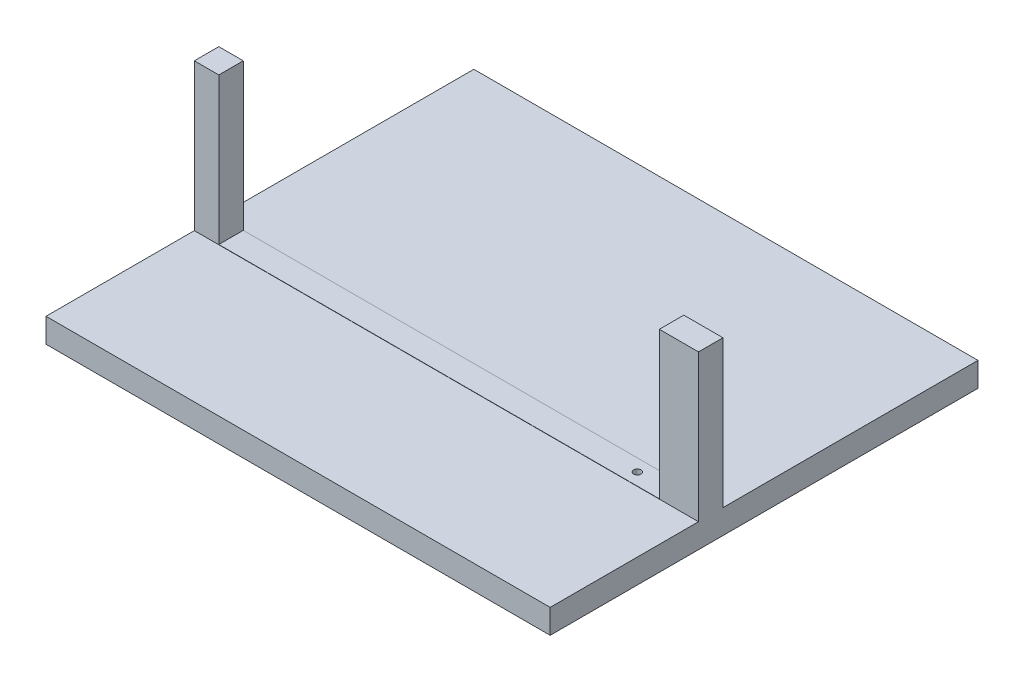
from build123d import *

# Parameters (mm, degrees)
ESQUISSE1_W                  = 50
ESQUISSE1_H                  = 300
BASE_EXTRUSION_DEPTH         = 50
ESQUISSE2_W                  = 1030
ESQUISSE2_H                  = 50
BOSS_EXTRU_1_DEPTH           = 50
ESQUISSE3_W                  = 80
ESQUISSE3_H                  = 50
BOSS_EXTRU_2_DEPTH           = 300
BOSS_EXTRU_3_DEPTH           = 49.5
ENL_V_MAT_EXTRU_1_DEPTH      = 20
ENL_V_MAT_EXTRU_1_DEPTH_BACK = 1193.619386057
ESQUISSE4_R                  = 7.5


with BuildPart() as part:
    # Esquisse1 → Base-Extrusion (new body)
    with BuildSketch(Plane.XY):
        with Locations((25, 150)):
            Rectangle(ESQUISSE1_W, ESQUISSE1_H)
    extrude(amount=BASE_EXTRUSION_DEPTH)

    # Esquisse2 → Boss.-Extru.1 (add)
    with BuildSketch(Plane.XZ):
        with Locations((515, 25)):
            Rectangle(ESQUISSE2_W, ESQUISSE2_H)
    extrude(amount=BOSS_EXTRU_1_DEPTH)

    # Esquisse3 → Boss.-Extru.2 (add)
    with BuildSketch(Plane(origin=(0, 0, 0), x_dir=(-1, 0, 0), z_dir=(0, 1, 0))):
        with Locations((-990, 25)):
            Rectangle(ESQUISSE3_W, ESQUISSE3_H)
    extrude(amount=BOSS_EXTRU_2_DEPTH)

    # Esquisse5 → Boss.-Extru.3 (add)
    with BuildSketch(Plane.XZ.offset(50)):
        Polygon((1030, 0), (1030, -521), (0, -521), (0, 353), (1030, 353), align=None)
    extrude(amount=-BOSS_EXTRU_3_DEPTH)

    # Esquisse4 → Enl_v. mat.-Extru.1 (cut, two sides: drawn at the far end of the back side and taken through both)
    with BuildSketch(Plane(origin=(0, 0, 0), x_dir=(-1, 0, 0), z_dir=(0, 1, 0)).offset(-ENL_V_MAT_EXTRU_1_DEPTH_BACK)):
        with Locations(Location((-880, 25, 0), (0, 0, 90))):
            Circle(ESQUISSE4_R)
    extrude(amount=ENL_V_MAT_EXTRU_1_DEPTH + ENL_V_MAT_EXTRU_1_DEPTH_BACK, mode=Mode.SUBTRACT)


solid = part.part
